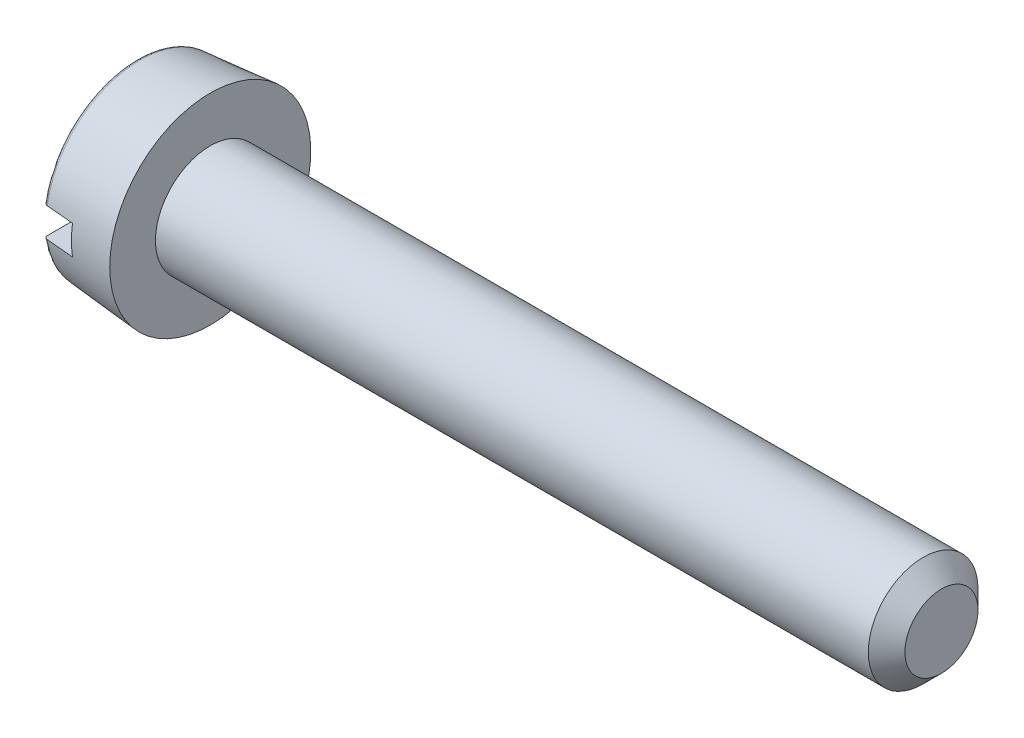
ISO-10303-21;
HEADER;
FILE_DESCRIPTION(('STEP AP214'),'2;1');
FILE_NAME('part.step','',(''),(''),'','','');
FILE_SCHEMA(('AUTOMOTIVE_DESIGN { 1 0 10303 214 1 1 1 1 }'));
ENDSEC;
DATA;
#1=APPLICATION_CONTEXT('core data for automotive mechanical design processes');
#2=APPLICATION_PROTOCOL_DEFINITION('international standard','automotive_design',2000,#1);
#3=PRODUCT_CONTEXT('',#1,'mechanical');
#4=PRODUCT('Part','Part','',(#3));
#5=PRODUCT_RELATED_PRODUCT_CATEGORY('part','',(#4));
#6=PRODUCT_DEFINITION_FORMATION('','',#4);
#7=PRODUCT_DEFINITION_CONTEXT('part definition',#1,'design');
#8=PRODUCT_DEFINITION('design','',#6,#7);
#9=PRODUCT_DEFINITION_SHAPE('','',#8);
#10=(LENGTH_UNIT() NAMED_UNIT(*) SI_UNIT(.MILLI.,.METRE.));
#11=(NAMED_UNIT(*) PLANE_ANGLE_UNIT() SI_UNIT($,.RADIAN.));
#12=(NAMED_UNIT(*) SI_UNIT($,.STERADIAN.) SOLID_ANGLE_UNIT());
#13=UNCERTAINTY_MEASURE_WITH_UNIT(LENGTH_MEASURE(1.E-05),#10,'distance_accuracy_value','');
#14=(GEOMETRIC_REPRESENTATION_CONTEXT(3) GLOBAL_UNCERTAINTY_ASSIGNED_CONTEXT((#13)) GLOBAL_UNIT_ASSIGNED_CONTEXT((#10,
#11,#12)) REPRESENTATION_CONTEXT('',''));
#15=CARTESIAN_POINT('',(0.,0.,0.));
#16=DIRECTION('',(0.,0.,1.));
#17=DIRECTION('',(1.,0.,0.));
#18=AXIS2_PLACEMENT_3D('',#15,#16,#17);
#19=CARTESIAN_POINT('',(0.,0.,0.));
#20=DIRECTION('',(-1.,0.,0.));
#21=DIRECTION('',(0.,0.,1.));
#22=AXIS2_PLACEMENT_3D('',#19,#20,#21);
#23=PLANE('',#22);
#24=DIRECTION('',(0.,0.,-1.));
#25=VECTOR('',#24,1.);
#26=CARTESIAN_POINT('',(0.,0.399999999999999,2.75));
#27=LINE('',#26,#25);
#28=CARTESIAN_POINT('',(0.,0.399999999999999,2.45096382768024));
#29=VERTEX_POINT('',#28);
#30=CARTESIAN_POINT('',(0.,0.399999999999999,-2.45096382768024));
#31=VERTEX_POINT('',#30);
#32=EDGE_CURVE('E103',#29,#31,#27,.T.);
#33=ORIENTED_EDGE('',*,*,#32,.F.);
#34=CARTESIAN_POINT('',(0.,0.,0.));
#35=DIRECTION('',(-1.,0.,0.));
#36=DIRECTION('',(0.,0.,1.));
#37=AXIS2_PLACEMENT_3D('',#34,#35,#36);
#38=CIRCLE('',#37,2.48338955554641);
#39=EDGE_CURVE('E106',#29,#31,#38,.T.);
#40=ORIENTED_EDGE('',*,*,#39,.T.);
#41=EDGE_LOOP('',(#33,#40));
#42=FACE_BOUND('',#41,.T.);
#43=ADVANCED_FACE('F35',(#42),#23,.T.);
#44=CARTESIAN_POINT('',(0.1,0.,0.));
#45=DIRECTION('',(-1.,0.,0.));
#46=DIRECTION('',(0.,0.,1.));
#47=AXIS2_PLACEMENT_3D('',#44,#45,#46);
#48=TOROIDAL_SURFACE('',#47,2.48338955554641,0.1);
#49=CARTESIAN_POINT('',(0.0485751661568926,0.399999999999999,-2.53782400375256));
#50=CARTESIAN_POINT('',(0.0533355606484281,0.399999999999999,-2.54071333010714));
#51=CARTESIAN_POINT('',(0.0583417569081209,0.399999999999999,-2.5432050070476));
#52=CARTESIAN_POINT('',(0.0687050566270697,0.399999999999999,-2.54731542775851));
#53=CARTESIAN_POINT('',(0.0740625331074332,0.399999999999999,-2.54893322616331));
#54=CARTESIAN_POINT('',(0.0849727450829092,0.399999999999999,-2.55124400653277));
#55=CARTESIAN_POINT('',(0.0905254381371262,0.399999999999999,-2.55193718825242));
#56=CARTESIAN_POINT('',(0.101666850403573,0.399999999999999,-2.55237774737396));
#57=CARTESIAN_POINT('',(0.107255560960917,0.399999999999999,-2.55212534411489));
#58=CARTESIAN_POINT('',(0.118292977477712,0.399999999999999,-2.55068537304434));
#59=CARTESIAN_POINT('',(0.123742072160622,0.399999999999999,-2.54950078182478));
#60=CARTESIAN_POINT('',(0.134364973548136,0.399999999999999,-2.54623584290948));
#61=CARTESIAN_POINT('',(0.139538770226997,0.399999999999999,-2.54415546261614));
#62=CARTESIAN_POINT('',(0.149479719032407,0.399999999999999,-2.53915450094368));
#63=CARTESIAN_POINT('',(0.1542457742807,0.399999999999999,-2.5362317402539));
#64=CARTESIAN_POINT('',(0.163225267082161,0.399999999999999,-2.52963434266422));
#65=CARTESIAN_POINT('',(0.167438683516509,0.399999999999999,-2.52595967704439));
#66=CARTESIAN_POINT('',(0.175235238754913,0.399999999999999,-2.51792797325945));
#67=CARTESIAN_POINT('',(0.178812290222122,0.399999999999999,-2.51356502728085));
#68=CARTESIAN_POINT('',(0.185193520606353,0.399999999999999,-2.50430657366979));
#69=CARTESIAN_POINT('',(0.187997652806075,0.399999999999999,-2.49941103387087));
#70=CARTESIAN_POINT('',(0.192789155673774,0.399999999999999,-2.48916309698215));
#71=CARTESIAN_POINT('',(0.194766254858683,0.399999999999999,-2.48380589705));
#72=CARTESIAN_POINT('',(0.197803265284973,0.399999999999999,-2.47283752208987));
#73=CARTESIAN_POINT('',(0.198863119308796,0.399999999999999,-2.46722633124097));
#74=CARTESIAN_POINT('',(0.200044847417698,0.399999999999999,-2.45584788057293));
#75=CARTESIAN_POINT('',(0.200157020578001,0.399999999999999,-2.45007961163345));
#76=CARTESIAN_POINT('',(0.199415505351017,0.399999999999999,-2.43860536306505));
#77=CARTESIAN_POINT('',(0.198561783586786,0.399999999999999,-2.43289938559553));
#78=CARTESIAN_POINT('',(0.195905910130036,0.399999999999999,-2.42168897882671));
#79=CARTESIAN_POINT('',(0.194100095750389,0.399999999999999,-2.41618541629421));
#80=CARTESIAN_POINT('',(0.189585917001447,0.399999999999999,-2.40556157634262));
#81=CARTESIAN_POINT('',(0.186877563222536,0.399999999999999,-2.40044129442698));
#82=CARTESIAN_POINT('',(0.180646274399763,0.399999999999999,-2.39075689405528));
#83=CARTESIAN_POINT('',(0.177127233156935,0.399999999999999,-2.38619027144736));
#84=CARTESIAN_POINT('',(0.16936410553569,0.399999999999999,-2.37772142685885));
#85=CARTESIAN_POINT('',(0.165120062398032,0.399999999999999,-2.37381916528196));
#86=CARTESIAN_POINT('',(0.15607995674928,0.399999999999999,-2.36683969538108));
#87=CARTESIAN_POINT('',(0.151290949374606,0.399999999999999,-2.36375335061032));
#88=CARTESIAN_POINT('',(0.14125723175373,0.399999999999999,-2.35844131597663));
#89=CARTESIAN_POINT('',(0.136012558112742,0.399999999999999,-2.35621555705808));
#90=CARTESIAN_POINT('',(0.125292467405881,0.399999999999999,-2.35271848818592));
#91=CARTESIAN_POINT('',(0.119821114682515,0.399999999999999,-2.35143471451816));
#92=CARTESIAN_POINT('',(0.10874007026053,0.399999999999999,-2.3498129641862));
#93=CARTESIAN_POINT('',(0.103130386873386,0.399999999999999,-2.34947493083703));
#94=CARTESIAN_POINT('',(0.0919839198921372,0.399999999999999,-2.34975394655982));
#95=CARTESIAN_POINT('',(0.0864469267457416,0.399999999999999,-2.3503627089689));
#96=CARTESIAN_POINT('',(0.0755538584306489,0.399999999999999,-2.35250103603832));
#97=CARTESIAN_POINT('',(0.0701977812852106,0.399999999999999,-2.35403059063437));
#98=CARTESIAN_POINT('',(0.0598152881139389,0.399999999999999,-2.35796437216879));
#99=CARTESIAN_POINT('',(0.0547889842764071,0.399999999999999,-2.36036889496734));
#100=CARTESIAN_POINT('',(0.0452064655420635,0.399999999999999,-2.36598034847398));
#101=CARTESIAN_POINT('',(0.040650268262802,0.399999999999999,-2.36918730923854));
#102=CARTESIAN_POINT('',(0.032091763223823,0.399999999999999,-2.37634229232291));
#103=CARTESIAN_POINT('',(0.0280948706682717,0.399999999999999,-2.38029679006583));
#104=CARTESIAN_POINT('',(0.0208109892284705,0.399999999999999,-2.3888128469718));
#105=CARTESIAN_POINT('',(0.0175240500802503,0.399999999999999,-2.39337444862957));
#106=CARTESIAN_POINT('',(0.0117067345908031,0.399999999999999,-2.4030406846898));
#107=CARTESIAN_POINT('',(0.00918709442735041,0.399999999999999,-2.40815178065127));
#108=CARTESIAN_POINT('',(0.00503040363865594,0.399999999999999,-2.41872109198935));
#109=CARTESIAN_POINT('',(0.00339341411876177,0.399999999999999,-2.42417933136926));
#110=CARTESIAN_POINT('',(0.00103079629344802,0.399999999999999,-2.43535569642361));
#111=CARTESIAN_POINT('',(0.000315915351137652,0.399999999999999,-2.44107609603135));
#112=CARTESIAN_POINT('',(-0.000148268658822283,0.399999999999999,-2.45255584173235));
#113=CARTESIAN_POINT('',(0.00010242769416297,0.399999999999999,-2.45831518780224));
#114=CARTESIAN_POINT('',(0.00156672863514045,0.399999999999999,-2.46973701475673));
#115=CARTESIAN_POINT('',(0.00278471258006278,0.399999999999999,-2.47539893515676));
#116=CARTESIAN_POINT('',(0.0061580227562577,0.399999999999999,-2.48643816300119));
#117=CARTESIAN_POINT('',(0.00831357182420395,0.399999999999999,-2.49181540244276));
#118=CARTESIAN_POINT('',(0.0134950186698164,0.399999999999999,-2.50210927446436));
#119=CARTESIAN_POINT('',(0.0165179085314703,0.399999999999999,-2.5070274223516));
#120=CARTESIAN_POINT('',(0.023352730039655,0.399999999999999,-2.51627478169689));
#121=CARTESIAN_POINT('',(0.0271636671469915,0.399999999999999,-2.52060472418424));
#122=CARTESIAN_POINT('',(0.0339390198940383,0.399999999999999,-2.52708853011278));
#123=CARTESIAN_POINT('',(0.0367007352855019,0.399999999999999,-2.52945777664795));
#124=CARTESIAN_POINT('',(0.04246511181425,0.399999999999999,-2.5338824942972));
#125=CARTESIAN_POINT('',(0.0454677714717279,0.399999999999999,-2.53593796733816));
#126=CARTESIAN_POINT('',(0.0485751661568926,0.399999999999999,-2.53782400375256));
#127=B_SPLINE_CURVE_WITH_KNOTS('',3,(#49,#50,#51,#52,#53,#54,#55,#56,#57,#58,#59,#60,#61,#62,
#63,#64,#65,#66,#67,#68,#69,#70,#71,#72,#73,#74,#75,#76,#77,#78,#79,#80,#81,#82,#83,#84,#85,#86,
#87,#88,#89,#90,#91,#92,#93,#94,#95,#96,#97,#98,#99,#100,#101,#102,#103,#104,#105,#106,#107,
#108,#109,#110,#111,#112,#113,#114,#115,#116,#117,#118,#119,#120,#121,#122,#123,#124,#125,#126),
.UNSPECIFIED.,.T.,.F.,(4,2,2,2,2,2,2,2,2,2,2,2,2,2,2,2,2,2,2,2,2,2,2,2,2,2,2,2,2,2,2,2,2,2,2,2,
2,2,4),(0.,0.0166927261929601,0.0334034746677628,0.0501106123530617,0.0668138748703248,
0.0834640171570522,0.100114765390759,0.116808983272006,0.133503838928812,0.150350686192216,
0.167198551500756,0.184249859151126,0.201302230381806,0.21852894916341,0.235756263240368,
0.253050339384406,0.270344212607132,0.287556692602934,0.304768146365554,0.321777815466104,
0.338786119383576,0.355565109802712,0.372343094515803,0.388975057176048,0.405606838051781,
0.422244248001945,0.438882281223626,0.455671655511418,0.472462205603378,0.489477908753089,
0.506494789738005,0.523708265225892,0.54092173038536,0.558213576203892,0.575509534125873,
0.592746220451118,0.609961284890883,0.620857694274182,0.631754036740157),.UNSPECIFIED.);
#128=CARTESIAN_POINT('',(0.0912844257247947,0.399999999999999,-2.55184945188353));
#129=VERTEX_POINT('',#128);
#130=EDGE_CURVE('E58',#31,#129,#127,.T.);
#131=ORIENTED_EDGE('',*,*,#130,.F.);
#132=ORIENTED_EDGE('',*,*,#39,.F.);
#133=CARTESIAN_POINT('',(0.066087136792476,0.399999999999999,2.35559521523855));
#134=CARTESIAN_POINT('',(0.0712950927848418,0.399999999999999,2.35369117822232));
#135=CARTESIAN_POINT('',(0.076666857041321,0.399999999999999,2.35222401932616));
#136=CARTESIAN_POINT('',(0.0875846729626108,0.399999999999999,2.35021144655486));
#137=CARTESIAN_POINT('',(0.0931309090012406,0.399999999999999,2.34966704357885));
#138=CARTESIAN_POINT('',(0.104234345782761,0.399999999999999,2.34951890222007));
#139=CARTESIAN_POINT('',(0.109791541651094,0.399999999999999,2.34991481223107));
#140=CARTESIAN_POINT('',(0.120758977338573,0.399999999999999,2.35163438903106));
#141=CARTESIAN_POINT('',(0.126169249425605,0.399999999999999,2.3529578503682));
#142=CARTESIAN_POINT('',(0.136691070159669,0.399999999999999,2.35649136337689));
#143=CARTESIAN_POINT('',(0.141802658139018,0.399999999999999,2.35870129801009));
#144=CARTESIAN_POINT('',(0.151586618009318,0.399999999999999,2.36394124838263));
#145=CARTESIAN_POINT('',(0.15625896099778,0.399999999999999,2.36697131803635));
#146=CARTESIAN_POINT('',(0.165074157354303,0.399999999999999,2.37379047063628));
#147=CARTESIAN_POINT('',(0.169212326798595,0.399999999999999,2.37758560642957));
#148=CARTESIAN_POINT('',(0.176803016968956,0.399999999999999,2.38580863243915));
#149=CARTESIAN_POINT('',(0.180255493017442,0.399999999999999,2.39023656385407));
#150=CARTESIAN_POINT('',(0.186425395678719,0.399999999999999,2.39966205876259));
#151=CARTESIAN_POINT('',(0.189132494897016,0.399999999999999,2.40466638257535));
#152=CARTESIAN_POINT('',(0.19367967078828,0.399999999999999,2.41505452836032));
#153=CARTESIAN_POINT('',(0.195519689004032,0.399999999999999,2.42043837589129));
#154=CARTESIAN_POINT('',(0.19830186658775,0.399999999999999,2.43150243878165));
#155=CARTESIAN_POINT('',(0.199232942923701,0.399999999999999,2.43718544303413));
#156=CARTESIAN_POINT('',(0.200133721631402,0.399999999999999,2.44862724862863));
#157=CARTESIAN_POINT('',(0.200103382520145,0.399999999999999,2.45438605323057));
#158=CARTESIAN_POINT('',(0.199078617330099,0.399999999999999,2.46584997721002));
#159=CARTESIAN_POINT('',(0.198078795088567,0.399999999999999,2.47155461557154));
#160=CARTESIAN_POINT('',(0.195132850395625,0.399999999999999,2.48271426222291));
#161=CARTESIAN_POINT('',(0.193186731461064,0.399999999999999,2.4881692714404));
#162=CARTESIAN_POINT('',(0.188406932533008,0.399999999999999,2.49865615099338));
#163=CARTESIAN_POINT('',(0.185575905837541,0.399999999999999,2.50368922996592));
#164=CARTESIAN_POINT('',(0.179101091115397,0.399999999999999,2.51320240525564));
#165=CARTESIAN_POINT('',(0.17545734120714,0.399999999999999,2.51768252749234));
#166=CARTESIAN_POINT('',(0.167497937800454,0.399999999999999,2.52591455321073));
#167=CARTESIAN_POINT('',(0.163189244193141,0.399999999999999,2.52967318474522));
#168=CARTESIAN_POINT('',(0.153995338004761,0.399999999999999,2.53640297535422));
#169=CARTESIAN_POINT('',(0.149110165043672,0.399999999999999,2.53937418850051));
#170=CARTESIAN_POINT('',(0.138966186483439,0.399999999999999,2.54440671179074));
#171=CARTESIAN_POINT('',(0.133712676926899,0.399999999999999,2.54647869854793));
#172=CARTESIAN_POINT('',(0.122930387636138,0.399999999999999,2.54970170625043));
#173=CARTESIAN_POINT('',(0.117401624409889,0.399999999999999,2.55085278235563));
#174=CARTESIAN_POINT('',(0.106281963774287,0.399999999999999,2.55219206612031));
#175=CARTESIAN_POINT('',(0.100692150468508,0.399999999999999,2.55238928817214));
#176=CARTESIAN_POINT('',(0.0895592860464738,0.399999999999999,2.55183933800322));
#177=CARTESIAN_POINT('',(0.0840162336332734,0.399999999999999,2.55109219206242));
#178=CARTESIAN_POINT('',(0.0731512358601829,0.399999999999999,2.5486799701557));
#179=CARTESIAN_POINT('',(0.0678286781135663,0.399999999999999,2.54701764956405));
#180=CARTESIAN_POINT('',(0.0575363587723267,0.399999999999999,2.54282694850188));
#181=CARTESIAN_POINT('',(0.0525666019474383,0.399999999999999,2.54029855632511));
#182=CARTESIAN_POINT('',(0.0430955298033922,0.399999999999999,2.53443716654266));
#183=CARTESIAN_POINT('',(0.03859644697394,0.399999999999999,2.53110056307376));
#184=CARTESIAN_POINT('',(0.0302151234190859,0.399999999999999,2.52372648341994));
#185=CARTESIAN_POINT('',(0.0263329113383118,0.399999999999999,2.51968897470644));
#186=CARTESIAN_POINT('',(0.0192521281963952,0.399999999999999,2.51098384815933));
#187=CARTESIAN_POINT('',(0.0160610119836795,0.399999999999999,2.5063101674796));
#188=CARTESIAN_POINT('',(0.0104977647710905,0.399999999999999,2.49649850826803));
#189=CARTESIAN_POINT('',(0.0081256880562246,0.399999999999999,2.49136049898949));
#190=CARTESIAN_POINT('',(0.00423822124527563,0.399999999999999,2.48069955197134));
#191=CARTESIAN_POINT('',(0.00273352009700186,0.399999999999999,2.4751727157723));
#192=CARTESIAN_POINT('',(0.000664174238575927,0.399999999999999,2.4639457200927));
#193=CARTESIAN_POINT('',(9.95845082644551E-05,0.399999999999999,2.45824555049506));
#194=CARTESIAN_POINT('',(-7.62295306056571E-05,0.399999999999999,2.4467793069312));
#195=CARTESIAN_POINT('',(0.000321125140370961,0.399999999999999,2.44101309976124));
#196=CARTESIAN_POINT('',(0.00207635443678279,0.399999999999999,2.42962883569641));
#197=CARTESIAN_POINT('',(0.00343421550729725,0.399999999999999,2.424010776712));
#198=CARTESIAN_POINT('',(0.00707734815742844,0.399999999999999,2.41307368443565));
#199=CARTESIAN_POINT('',(0.00936409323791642,0.399999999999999,2.4077551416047));
#200=CARTESIAN_POINT('',(0.014804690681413,0.399999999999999,2.39757966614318));
#201=CARTESIAN_POINT('',(0.0179587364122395,0.399999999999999,2.39272283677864));
#202=CARTESIAN_POINT('',(0.0250240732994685,0.399999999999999,2.38364579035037));
#203=CARTESIAN_POINT('',(0.0289303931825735,0.399999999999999,2.37942170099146));
#204=CARTESIAN_POINT('',(0.0374021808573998,0.399999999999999,2.3717039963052));
#205=CARTESIAN_POINT('',(0.0419667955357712,0.399999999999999,2.36820944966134));
#206=CARTESIAN_POINT('',(0.0498248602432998,0.399999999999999,2.3632007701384));
#207=CARTESIAN_POINT('',(0.0529598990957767,0.399999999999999,2.36143340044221));
#208=CARTESIAN_POINT('',(0.0594027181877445,0.399999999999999,2.35824787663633));
#209=CARTESIAN_POINT('',(0.062710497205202,0.399999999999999,2.35682972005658));
#210=CARTESIAN_POINT('',(0.066087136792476,0.399999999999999,2.35559521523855));
#211=B_SPLINE_CURVE_WITH_KNOTS('',3,(#133,#134,#135,#136,#137,#138,#139,#140,#141,#142,#143,
#144,#145,#146,#147,#148,#149,#150,#151,#152,#153,#154,#155,#156,#157,#158,#159,#160,#161,#162,
#163,#164,#165,#166,#167,#168,#169,#170,#171,#172,#173,#174,#175,#176,#177,#178,#179,#180,#181,
#182,#183,#184,#185,#186,#187,#188,#189,#190,#191,#192,#193,#194,#195,#196,#197,#198,#199,#200,
#201,#202,#203,#204,#205,#206,#207,#208,#209,#210),.UNSPECIFIED.,.T.,.F.,(4,2,2,2,2,2,2,2,2,2,2,
2,2,2,2,2,2,2,2,2,2,2,2,2,2,2,2,2,2,2,2,2,2,2,2,2,2,2,4),(0.,0.0166222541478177,
0.0332627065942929,0.0498969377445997,0.0665274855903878,0.0831558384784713,0.0997852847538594,
0.116551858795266,0.133319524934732,0.150308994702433,0.16729960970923,0.184494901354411,
0.201690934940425,0.218983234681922,0.236275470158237,0.253516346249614,0.270756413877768,
0.287826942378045,0.304896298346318,0.321757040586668,0.338616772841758,0.355316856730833,
0.372016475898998,0.388666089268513,0.405315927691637,0.422041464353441,0.438767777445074,
0.455666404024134,0.472566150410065,0.489669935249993,0.506774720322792,0.524032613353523,
0.541290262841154,0.558575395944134,0.575864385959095,0.593042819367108,0.610199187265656,
0.620976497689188,0.631753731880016),.UNSPECIFIED.);
#212=CARTESIAN_POINT('',(0.0912844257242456,0.399999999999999,2.55184945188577));
#213=VERTEX_POINT('',#212);
#214=EDGE_CURVE('E95',#213,#29,#211,.T.);
#215=ORIENTED_EDGE('',*,*,#214,.F.);
#216=CARTESIAN_POINT('',(0.0912844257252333,0.,0.));
#217=DIRECTION('',(-1.,0.,0.));
#218=DIRECTION('',(0.,0.,1.));
#219=AXIS2_PLACEMENT_3D('',#216,#217,#218);
#220=CIRCLE('',#219,2.58300902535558);
#221=EDGE_CURVE('E110',#129,#213,#220,.F.);
#222=ORIENTED_EDGE('',*,*,#221,.F.);
#223=EDGE_LOOP('',(#131,#132,#215,#222));
#224=FACE_BOUND('',#223,.T.);
#225=ADVANCED_FACE('F179',(#224),#48,.T.);
#226=CARTESIAN_POINT('',(-25.4,0.,0.));
#227=DIRECTION('',(-1.,0.,0.));
#228=DIRECTION('',(0.,0.,1.));
#229=AXIS2_PLACEMENT_3D('',#226,#227,#228);
#230=CYLINDRICAL_SURFACE('',#229,1.5);
#231=CARTESIAN_POINT('',(21.5,0.,0.));
#232=DIRECTION('',(1.,0.,0.));
#233=DIRECTION('',(0.,0.,-1.));
#234=AXIS2_PLACEMENT_3D('',#231,#232,#233);
#235=CIRCLE('',#234,1.5);
#236=CARTESIAN_POINT('',(21.5,0.,-1.5));
#237=VERTEX_POINT('',#236);
#238=EDGE_CURVE('E43',#237,#237,#235,.F.);
#239=ORIENTED_EDGE('',*,*,#238,.T.);
#240=EDGE_LOOP('',(#239));
#241=FACE_BOUND('',#240,.T.);
#242=CARTESIAN_POINT('',(2.,0.,0.));
#243=DIRECTION('',(-1.,0.,0.));
#244=DIRECTION('',(0.,0.,1.));
#245=AXIS2_PLACEMENT_3D('',#242,#243,#244);
#246=CIRCLE('',#245,1.5);
#247=CARTESIAN_POINT('',(2.,0.,1.5));
#248=VERTEX_POINT('',#247);
#249=EDGE_CURVE('E107',#248,#248,#246,.T.);
#250=ORIENTED_EDGE('',*,*,#249,.F.);
#251=EDGE_LOOP('',(#250));
#252=FACE_BOUND('',#251,.T.);
#253=ADVANCED_FACE('F37',(#241,#252),#230,.T.);
#254=CARTESIAN_POINT('',(2.,1.5,0.));
#255=DIRECTION('',(-1.,0.,0.));
#256=DIRECTION('',(0.,0.,1.));
#257=AXIS2_PLACEMENT_3D('',#254,#255,#256);
#258=PLANE('',#257);
#259=CARTESIAN_POINT('',(2.,0.,0.));
#260=DIRECTION('',(-1.,0.,0.));
#261=DIRECTION('',(0.,0.,1.));
#262=AXIS2_PLACEMENT_3D('',#259,#260,#261);
#263=CIRCLE('',#262,2.75);
#264=CARTESIAN_POINT('',(2.,0.,2.75));
#265=VERTEX_POINT('',#264);
#266=EDGE_CURVE('E112',#265,#265,#263,.T.);
#267=ORIENTED_EDGE('',*,*,#266,.F.);
#268=EDGE_LOOP('',(#267));
#269=FACE_BOUND('',#268,.T.);
#270=ORIENTED_EDGE('',*,*,#249,.T.);
#271=EDGE_LOOP('',(#270));
#272=FACE_BOUND('',#271,.T.);
#273=ADVANCED_FACE('F156',(#269,#272),#258,.F.);
#274=CARTESIAN_POINT('',(0.,0.,0.));
#275=DIRECTION('',(1.,0.,0.));
#276=DIRECTION('',(0.,0.,-1.));
#277=AXIS2_PLACEMENT_3D('',#274,#275,#276);
#278=CONICAL_SURFACE('',#277,2.57502267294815,0.0872664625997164);
#279=CARTESIAN_POINT('',(5.21123588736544,0.399999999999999,3.00443640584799));
#280=CARTESIAN_POINT('',(4.41342358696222,0.399999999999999,2.93401988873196));
#281=CARTESIAN_POINT('',(3.61561486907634,0.399999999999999,2.86356274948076));
#282=CARTESIAN_POINT('',(2.02000692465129,0.399999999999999,2.72254136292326));
#283=CARTESIAN_POINT('',(1.22220769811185,0.399999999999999,2.65197711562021));
#284=CARTESIAN_POINT('',(-0.373378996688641,0.399999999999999,2.51071564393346));
#285=CARTESIAN_POINT('',(-1.17116646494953,0.399999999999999,2.44001841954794));
#286=CARTESIAN_POINT('',(-2.76672581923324,0.399999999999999,2.298448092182));
#287=CARTESIAN_POINT('',(-3.56449770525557,0.399999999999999,2.22757498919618));
#288=CARTESIAN_POINT('',(-4.36225986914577,0.399999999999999,2.15659249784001));
#289=B_SPLINE_CURVE_WITH_KNOTS('',3,(#279,#280,#281,#282,#283,#284,#285,#286,#287,#288),
.UNSPECIFIED.,.F.,.F.,(4,2,2,2,4),(0.,2.40274147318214,4.80548287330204,7.20822430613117,
9.6109658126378),.UNSPECIFIED.);
#290=CARTESIAN_POINT('',(0.85,0.399999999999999,2.61901832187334));
#291=VERTEX_POINT('',#290);
#292=EDGE_CURVE('E162',#291,#213,#289,.T.);
#293=ORIENTED_EDGE('',*,*,#292,.F.);
#294=CARTESIAN_POINT('',(0.85,0.,0.));
#295=DIRECTION('',(1.,0.,0.));
#296=DIRECTION('',(0.,0.,-1.));
#297=AXIS2_PLACEMENT_3D('',#294,#295,#296);
#298=CIRCLE('',#297,2.64938803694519);
#299=CARTESIAN_POINT('',(0.85,-0.4,2.61901832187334));
#300=VERTEX_POINT('',#299);
#301=EDGE_CURVE('E206',#300,#291,#298,.F.);
#302=ORIENTED_EDGE('',*,*,#301,.F.);
#303=CARTESIAN_POINT('',(-4.36225986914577,-0.4,2.15659249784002));
#304=CARTESIAN_POINT('',(-3.02252879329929,-0.4,2.27578971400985));
#305=CARTESIAN_POINT('',(-1.68277158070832,-0.4,2.3946924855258));
#306=CARTESIAN_POINT('',(-0.0871929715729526,-0.4,2.5360455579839));
#307=CARTESIAN_POINT('',(0.168610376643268,-0.4,2.55869953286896));
#308=CARTESIAN_POINT('',(2.02000114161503,-0.4,2.72260692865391));
#309=CARTESIAN_POINT('',(3.61561248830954,-0.4,2.86359016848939));
#310=CARTESIAN_POINT('',(5.21123588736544,-0.4,3.00443640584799));
#311=B_SPLINE_CURVE_WITH_KNOTS('',3,(#303,#304,#305,#306,#307,#308,#309,#310),.UNSPECIFIED.,.F.,
.F.,(4,2,2,4),(0.,4.03506939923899,4.80548292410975,9.61096578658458),.UNSPECIFIED.);
#312=CARTESIAN_POINT('',(0.0912844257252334,-0.4,2.5518494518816));
#313=VERTEX_POINT('',#312);
#314=EDGE_CURVE('E140',#313,#300,#311,.T.);
#315=ORIENTED_EDGE('',*,*,#314,.F.);
#316=CARTESIAN_POINT('',(0.0912844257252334,-0.4,-2.55184945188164));
#317=VERTEX_POINT('',#316);
#318=EDGE_CURVE('E116',#313,#317,#220,.F.);
#319=ORIENTED_EDGE('',*,*,#318,.T.);
#320=CARTESIAN_POINT('',(5.21123588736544,-0.4,-3.00443640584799));
#321=CARTESIAN_POINT('',(4.41342358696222,-0.4,-2.93401988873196));
#322=CARTESIAN_POINT('',(3.61561486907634,-0.4,-2.86356274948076));
#323=CARTESIAN_POINT('',(2.02000692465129,-0.4,-2.72254136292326));
#324=CARTESIAN_POINT('',(1.22220769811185,-0.4,-2.65197711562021));
#325=CARTESIAN_POINT('',(-0.373378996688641,-0.4,-2.51071564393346));
#326=CARTESIAN_POINT('',(-1.17116646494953,-0.4,-2.44001841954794));
#327=CARTESIAN_POINT('',(-2.76672581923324,-0.4,-2.298448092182));
#328=CARTESIAN_POINT('',(-3.56449770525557,-0.4,-2.22757498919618));
#329=CARTESIAN_POINT('',(-4.36225986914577,-0.4,-2.15659249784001));
#330=B_SPLINE_CURVE_WITH_KNOTS('',3,(#320,#321,#322,#323,#324,#325,#326,#327,#328,#329),
.UNSPECIFIED.,.F.,.F.,(4,2,2,2,4),(0.,2.40274147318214,4.80548287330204,7.20822430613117,
9.6109658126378),.UNSPECIFIED.);
#331=CARTESIAN_POINT('',(0.85,-0.4,-2.61901832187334));
#332=VERTEX_POINT('',#331);
#333=EDGE_CURVE('E90',#332,#317,#330,.T.);
#334=ORIENTED_EDGE('',*,*,#333,.F.);
#335=CARTESIAN_POINT('',(0.85,0.399999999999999,-2.61901832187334));
#336=VERTEX_POINT('',#335);
#337=EDGE_CURVE('E207',#336,#332,#298,.F.);
#338=ORIENTED_EDGE('',*,*,#337,.F.);
#339=CARTESIAN_POINT('',(-4.36225986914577,0.399999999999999,-2.15659249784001));
#340=CARTESIAN_POINT('',(-3.02252879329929,0.399999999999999,-2.27578971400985));
#341=CARTESIAN_POINT('',(-1.68277158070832,0.399999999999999,-2.3946924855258));
#342=CARTESIAN_POINT('',(-0.0871929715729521,0.399999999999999,-2.5360455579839));
#343=CARTESIAN_POINT('',(0.168610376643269,0.399999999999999,-2.55869953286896));
#344=CARTESIAN_POINT('',(2.02000114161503,0.399999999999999,-2.72260692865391));
#345=CARTESIAN_POINT('',(3.61561248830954,0.399999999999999,-2.86359016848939));
#346=CARTESIAN_POINT('',(5.21123588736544,0.399999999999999,-3.00443640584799));
#347=B_SPLINE_CURVE_WITH_KNOTS('',3,(#339,#340,#341,#342,#343,#344,#345,#346),.UNSPECIFIED.,.F.,
.F.,(4,2,2,4),(0.,4.03506939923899,4.80548292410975,9.61096578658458),.UNSPECIFIED.);
#348=EDGE_CURVE('E166',#129,#336,#347,.T.);
#349=ORIENTED_EDGE('',*,*,#348,.F.);
#350=ORIENTED_EDGE('',*,*,#221,.T.);
#351=EDGE_LOOP('',(#293,#302,#315,#319,#334,#338,#349,#350));
#352=FACE_BOUND('',#351,.T.);
#353=ORIENTED_EDGE('',*,*,#266,.T.);
#354=EDGE_LOOP('',(#353));
#355=FACE_BOUND('',#354,.T.);
#356=ADVANCED_FACE('F152',(#352,#355),#278,.T.);
#357=DIRECTION('',(0.,0.,1.));
#358=VECTOR('',#357,1.);
#359=CARTESIAN_POINT('',(0.,-0.4,-2.75));
#360=LINE('',#359,#358);
#361=CARTESIAN_POINT('',(0.,-0.4,-2.45096382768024));
#362=VERTEX_POINT('',#361);
#363=CARTESIAN_POINT('',(0.,-0.4,2.45096382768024));
#364=VERTEX_POINT('',#363);
#365=EDGE_CURVE('E50',#362,#364,#360,.T.);
#366=ORIENTED_EDGE('',*,*,#365,.F.);
#367=EDGE_CURVE('E101',#362,#364,#38,.T.);
#368=ORIENTED_EDGE('',*,*,#367,.T.);
#369=EDGE_LOOP('',(#366,#368));
#370=FACE_BOUND('',#369,.T.);
#371=ADVANCED_FACE('F100',(#370),#23,.T.);
#372=CARTESIAN_POINT('',(22.,1.5,0.));
#373=DIRECTION('',(1.,0.,0.));
#374=DIRECTION('',(0.,0.,-1.));
#375=AXIS2_PLACEMENT_3D('',#372,#373,#374);
#376=PLANE('',#375);
#377=CARTESIAN_POINT('',(22.,0.,0.));
#378=DIRECTION('',(1.,0.,0.));
#379=DIRECTION('',(0.,0.,-1.));
#380=AXIS2_PLACEMENT_3D('',#377,#378,#379);
#381=CIRCLE('',#380,1.);
#382=CARTESIAN_POINT('',(22.,0.,-1.));
#383=VERTEX_POINT('',#382);
#384=EDGE_CURVE('E11',#383,#383,#381,.T.);
#385=ORIENTED_EDGE('',*,*,#384,.T.);
#386=EDGE_LOOP('',(#385));
#387=FACE_BOUND('',#386,.T.);
#388=ADVANCED_FACE('F192',(#387),#376,.T.);
#389=CARTESIAN_POINT('',(0.0485751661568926,-0.4,-2.53782400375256));
#390=CARTESIAN_POINT('',(0.0437427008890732,-0.4,-2.53489033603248));
#391=CARTESIAN_POINT('',(0.0391565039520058,-0.4,-2.53154249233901));
#392=CARTESIAN_POINT('',(0.0306096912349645,-0.4,-2.52411912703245));
#393=CARTESIAN_POINT('',(0.0266499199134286,-0.4,-2.52004263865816));
#394=CARTESIAN_POINT('',(0.019472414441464,-0.4,-2.51128827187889));
#395=CARTESIAN_POINT('',(0.0162539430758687,-0.4,-2.5066109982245));
#396=CARTESIAN_POINT('',(0.010640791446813,-0.4,-2.49678789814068));
#397=CARTESIAN_POINT('',(0.0082459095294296,-0.4,-2.4916421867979));
#398=CARTESIAN_POINT('',(0.00432284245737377,-0.4,-2.48097764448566));
#399=CARTESIAN_POINT('',(0.00280265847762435,-0.4,-2.47545587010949));
#400=CARTESIAN_POINT('',(0.000701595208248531,-0.4,-2.46423612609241));
#401=CARTESIAN_POINT('',(0.000120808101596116,-0.4,-2.45853813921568));
#402=CARTESIAN_POINT('',(-8.77639340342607E-05,-0.4,-2.44707338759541));
#403=CARTESIAN_POINT('',(0.00029305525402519,-0.4,-2.44130646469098));
#404=CARTESIAN_POINT('',(0.00201549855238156,-0.4,-2.42991778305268));
#405=CARTESIAN_POINT('',(0.00335714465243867,-0.4,-2.42429602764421));
#406=CARTESIAN_POINT('',(0.00696895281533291,-0.4,-2.41334782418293));
#407=CARTESIAN_POINT('',(0.0092407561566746,-0.4,-2.40802191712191));
#408=CARTESIAN_POINT('',(0.0146521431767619,-0.4,-2.39783066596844));
#409=CARTESIAN_POINT('',(0.0177917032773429,-0.4,-2.39296530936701));
#410=CARTESIAN_POINT('',(0.0248287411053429,-0.4,-2.38387042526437));
#411=CARTESIAN_POINT('',(0.0287209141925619,-0.4,-2.37963679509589));
#412=CARTESIAN_POINT('',(0.0371689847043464,-0.4,-2.37189344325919));
#413=CARTESIAN_POINT('',(0.0417248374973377,-0.4,-2.36838367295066));
#414=CARTESIAN_POINT('',(0.0513088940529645,-0.4,-2.36223607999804));
#415=CARTESIAN_POINT('',(0.0563303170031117,-0.4,-2.35958768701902));
#416=CARTESIAN_POINT('',(0.0667506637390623,-0.4,-2.35518417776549));
#417=CARTESIAN_POINT('',(0.0721495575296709,-0.4,-2.35342899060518));
#418=CARTESIAN_POINT('',(0.0830969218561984,-0.4,-2.35088371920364));
#419=CARTESIAN_POINT('',(0.08864257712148,-0.4,-2.35008151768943));
#420=CARTESIAN_POINT('',(0.0997895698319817,-0.4,-2.34942645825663));
#421=CARTESIAN_POINT('',(0.105390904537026,-0.4,-2.34957355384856));
#422=CARTESIAN_POINT('',(0.116450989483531,-0.4,-2.35080823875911));
#423=CARTESIAN_POINT('',(0.121910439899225,-0.4,-2.35188957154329));
#424=CARTESIAN_POINT('',(0.132571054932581,-0.4,-2.35495102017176));
#425=CARTESIAN_POINT('',(0.137772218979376,-0.4,-2.35693113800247));
#426=CARTESIAN_POINT('',(0.147785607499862,-0.4,-2.36173694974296));
#427=CARTESIAN_POINT('',(0.152596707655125,-0.4,-2.36456498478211));
#428=CARTESIAN_POINT('',(0.161682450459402,-0.4,-2.37098051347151));
#429=CARTESIAN_POINT('',(0.165957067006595,-0.4,-2.3745680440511));
#430=CARTESIAN_POINT('',(0.173898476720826,-0.4,-2.38244089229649));
#431=CARTESIAN_POINT('',(0.177558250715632,-0.4,-2.38673328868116));
#432=CARTESIAN_POINT('',(0.184116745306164,-0.4,-2.39586460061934));
#433=CARTESIAN_POINT('',(0.187015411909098,-0.4,-2.40070355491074));
#434=CARTESIAN_POINT('',(0.192010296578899,-0.4,-2.41086084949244));
#435=CARTESIAN_POINT('',(0.194095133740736,-0.4,-2.41618478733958));
#436=CARTESIAN_POINT('',(0.197351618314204,-0.4,-2.42710502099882));
#437=CARTESIAN_POINT('',(0.198523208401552,-0.4,-2.43270133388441));
#438=CARTESIAN_POINT('',(0.199929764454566,-0.4,-2.44406834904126));
#439=CARTESIAN_POINT('',(0.200155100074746,-0.4,-2.4498402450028));
#440=CARTESIAN_POINT('',(0.199636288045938,-0.4,-2.4613404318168));
#441=CARTESIAN_POINT('',(0.198892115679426,-0.4,-2.46706872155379));
#442=CARTESIAN_POINT('',(0.196450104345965,-0.4,-2.47833342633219));
#443=CARTESIAN_POINT('',(0.19474990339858,-0.4,-2.48386932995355));
#444=CARTESIAN_POINT('',(0.190438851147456,-0.4,-2.49457461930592));
#445=CARTESIAN_POINT('',(0.18782801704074,-0.4,-2.49974401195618));
#446=CARTESIAN_POINT('',(0.181784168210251,-0.4,-2.50953562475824));
#447=CARTESIAN_POINT('',(0.178356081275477,-0.4,-2.51416088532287));
#448=CARTESIAN_POINT('',(0.170763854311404,-0.4,-2.52276187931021));
#449=CARTESIAN_POINT('',(0.166599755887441,-0.4,-2.52673764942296));
#450=CARTESIAN_POINT('',(0.157703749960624,-0.4,-2.53387831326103));
#451=CARTESIAN_POINT('',(0.152978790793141,-0.4,-2.53705186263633));
#452=CARTESIAN_POINT('',(0.143058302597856,-0.4,-2.54254944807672));
#453=CARTESIAN_POINT('',(0.137862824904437,-0.4,-2.54487357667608));
#454=CARTESIAN_POINT('',(0.127215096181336,-0.4,-2.54857855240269));
#455=CARTESIAN_POINT('',(0.121766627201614,-0.4,-2.54997027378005));
#456=CARTESIAN_POINT('',(0.110711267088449,-0.4,-2.55181190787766));
#457=CARTESIAN_POINT('',(0.105104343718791,-0.4,-2.55226162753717));
#458=CARTESIAN_POINT('',(0.0939347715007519,-0.4,-2.552205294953));
#459=CARTESIAN_POINT('',(0.0883720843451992,-0.4,-2.55170582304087));
#460=CARTESIAN_POINT('',(0.0774146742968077,-0.4,-2.54977933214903));
#461=CARTESIAN_POINT('',(0.0720197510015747,-0.4,-2.54835346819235));
#462=CARTESIAN_POINT('',(0.0636134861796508,-0.4,-2.54535751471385));
#463=CARTESIAN_POINT('',(0.0605001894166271,-0.4,-2.54406538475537));
#464=CARTESIAN_POINT('',(0.0544205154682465,-0.4,-2.54117250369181));
#465=CARTESIAN_POINT('',(0.0514541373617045,-0.4,-2.53957175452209));
#466=CARTESIAN_POINT('',(0.0485751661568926,-0.4,-2.53782400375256));
#467=B_SPLINE_CURVE_WITH_KNOTS('',3,(#389,#390,#391,#392,#393,#394,#395,#396,#397,#398,#399,
#400,#401,#402,#403,#404,#405,#406,#407,#408,#409,#410,#411,#412,#413,#414,#415,#416,#417,#418,
#419,#420,#421,#422,#423,#424,#425,#426,#427,#428,#429,#430,#431,#432,#433,#434,#435,#436,#437,
#438,#439,#440,#441,#442,#443,#444,#445,#446,#447,#448,#449,#450,#451,#452,#453,#454,#455,#456,
#457,#458,#459,#460,#461,#462,#463,#464,#465,#466),.UNSPECIFIED.,.T.,.F.,(4,2,2,2,2,2,2,2,2,2,2,
2,2,2,2,2,2,2,2,2,2,2,2,2,2,2,2,2,2,2,2,2,2,2,2,2,2,2,4),(0.,0.0169472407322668,
0.0339171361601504,0.0508700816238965,0.0678188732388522,0.0849203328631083,0.102023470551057,
0.119280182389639,0.136537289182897,0.153824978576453,0.171112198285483,0.188281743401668,
0.205450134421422,0.222399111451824,0.239346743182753,0.256076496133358,0.272805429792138,
0.289423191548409,0.306040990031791,0.322705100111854,0.339370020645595,0.356213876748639,
0.3730589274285,0.390131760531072,0.407205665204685,0.424452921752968,0.441700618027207,
0.458991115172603,0.476281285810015,0.493469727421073,0.510657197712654,0.527650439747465,
0.544641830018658,0.561431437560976,0.578224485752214,0.594901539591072,0.611557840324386,
0.621654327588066,0.631750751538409),.UNSPECIFIED.);
#468=EDGE_CURVE('E86',#317,#362,#467,.T.);
#469=ORIENTED_EDGE('',*,*,#468,.F.);
#470=ORIENTED_EDGE('',*,*,#318,.F.);
#471=CARTESIAN_POINT('',(0.066087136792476,-0.4,2.35559521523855));
#472=CARTESIAN_POINT('',(0.0608105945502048,-0.4,2.35752487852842));
#473=CARTESIAN_POINT('',(0.0556944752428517,-0.4,2.3599059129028));
#474=CARTESIAN_POINT('',(0.0459323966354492,-0.4,2.36549830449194));
#475=CARTESIAN_POINT('',(0.0412870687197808,-0.4,2.36871075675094));
#476=CARTESIAN_POINT('',(0.0326043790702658,-0.4,2.37586468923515));
#477=CARTESIAN_POINT('',(0.0285663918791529,-0.4,2.37980541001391));
#478=CARTESIAN_POINT('',(0.0212026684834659,-0.4,2.38830165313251));
#479=CARTESIAN_POINT('',(0.0178767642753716,-0.4,2.39285703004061));
#480=CARTESIAN_POINT('',(0.0119934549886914,-0.4,2.4025019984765));
#481=CARTESIAN_POINT('',(0.00944402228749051,-0.4,2.40759645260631));
#482=CARTESIAN_POINT('',(0.00522519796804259,-0.4,2.41813782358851));
#483=CARTESIAN_POINT('',(0.00355590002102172,-0.4,2.42358477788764));
#484=CARTESIAN_POINT('',(0.00112661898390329,-0.4,2.43474435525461));
#485=CARTESIAN_POINT('',(0.000377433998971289,-0.4,2.44045933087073));
#486=CARTESIAN_POINT('',(-0.000155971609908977,-0.4,2.45193424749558));
#487=CARTESIAN_POINT('',(5.9843753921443E-05,-0.4,2.45769419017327));
#488=CARTESIAN_POINT('',(0.0014548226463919,-0.4,2.4691245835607));
#489=CARTESIAN_POINT('',(0.00263861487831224,-0.4,2.47479447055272));
#490=CARTESIAN_POINT('',(0.00594479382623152,-0.4,2.48585382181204));
#491=CARTESIAN_POINT('',(0.0080671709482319,-0.4,2.4912432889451));
#492=CARTESIAN_POINT('',(0.0131842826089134,-0.4,2.50156580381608));
#493=CARTESIAN_POINT('',(0.0161757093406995,-0.4,2.50650049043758));
#494=CARTESIAN_POINT('',(0.0229526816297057,-0.4,2.51579078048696));
#495=CARTESIAN_POINT('',(0.0267381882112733,-0.4,2.52014641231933));
#496=CARTESIAN_POINT('',(0.0349549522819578,-0.4,2.52810621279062));
#497=CARTESIAN_POINT('',(0.0393791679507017,-0.4,2.53171764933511));
#498=CARTESIAN_POINT('',(0.0487773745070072,-0.4,2.53813557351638));
#499=CARTESIAN_POINT('',(0.0537513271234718,-0.4,2.54094211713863));
#500=CARTESIAN_POINT('',(0.0640426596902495,-0.4,2.54563498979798));
#501=CARTESIAN_POINT('',(0.0693551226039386,-0.4,2.5475321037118));
#502=CARTESIAN_POINT('',(0.0802247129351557,-0.4,2.55039839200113));
#503=CARTESIAN_POINT('',(0.0857818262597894,-0.4,2.55136761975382));
#504=CARTESIAN_POINT('',(0.0969295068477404,-0.4,2.55234385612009));
#505=CARTESIAN_POINT('',(0.102519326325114,-0.4,2.55235942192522));
#506=CARTESIAN_POINT('',(0.113621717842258,-0.4,2.55144947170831));
#507=CARTESIAN_POINT('',(0.119134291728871,-0.4,2.55052397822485));
#508=CARTESIAN_POINT('',(0.12991315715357,-0.4,2.54776325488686));
#509=CARTESIAN_POINT('',(0.135179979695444,-0.4,2.54593009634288));
#510=CARTESIAN_POINT('',(0.14533338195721,-0.4,2.54141002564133));
#511=CARTESIAN_POINT('',(0.150219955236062,-0.4,2.53872309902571));
#512=CARTESIAN_POINT('',(0.159502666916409,-0.4,2.5325586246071));
#513=CARTESIAN_POINT('',(0.163896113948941,-0.4,2.52907702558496));
#514=CARTESIAN_POINT('',(0.172043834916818,-0.4,2.52143276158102));
#515=CARTESIAN_POINT('',(0.175798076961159,-0.4,2.51727006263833));
#516=CARTESIAN_POINT('',(0.182604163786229,-0.4,2.50833478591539));
#517=CARTESIAN_POINT('',(0.185648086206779,-0.4,2.50355617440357));
#518=CARTESIAN_POINT('',(0.19090152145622,-0.4,2.49356047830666));
#519=CARTESIAN_POINT('',(0.193110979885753,-0.4,2.4883433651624));
#520=CARTESIAN_POINT('',(0.196659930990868,-0.4,2.47755170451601));
#521=CARTESIAN_POINT('',(0.197988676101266,-0.4,2.47197362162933));
#522=CARTESIAN_POINT('',(0.199699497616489,-0.4,2.46067407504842));
#523=CARTESIAN_POINT('',(0.20008152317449,-0.4,2.45495260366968));
#524=CARTESIAN_POINT('',(0.199888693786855,-0.4,2.44347761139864));
#525=CARTESIAN_POINT('',(0.199305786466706,-0.4,2.43772422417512));
#526=CARTESIAN_POINT('',(0.197183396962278,-0.4,2.42639649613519));
#527=CARTESIAN_POINT('',(0.195643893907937,-0.4,2.42082215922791));
#528=CARTESIAN_POINT('',(0.191647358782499,-0.4,2.41000689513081));
#529=CARTESIAN_POINT('',(0.189189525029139,-0.4,2.40476626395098));
#530=CARTESIAN_POINT('',(0.183422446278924,-0.4,2.39477626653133));
#531=CARTESIAN_POINT('',(0.180113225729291,-0.4,2.39002688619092));
#532=CARTESIAN_POINT('',(0.172762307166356,-0.4,2.38119455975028));
#533=CARTESIAN_POINT('',(0.168726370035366,-0.4,2.37710682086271));
#534=CARTESIAN_POINT('',(0.160017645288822,-0.4,2.36967805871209));
#535=CARTESIAN_POINT('',(0.155344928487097,-0.4,2.36633695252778));
#536=CARTESIAN_POINT('',(0.145561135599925,-0.4,2.36054338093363));
#537=CARTESIAN_POINT('',(0.140456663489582,-0.4,2.35807976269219));
#538=CARTESIAN_POINT('',(0.129901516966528,-0.4,2.35405629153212));
#539=CARTESIAN_POINT('',(0.124450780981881,-0.4,2.35249659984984));
#540=CARTESIAN_POINT('',(0.113430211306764,-0.4,2.35034396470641));
#541=CARTESIAN_POINT('',(0.107862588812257,-0.4,2.34973965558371));
#542=CARTESIAN_POINT('',(0.0967101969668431,-0.4,2.34948171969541));
#543=CARTESIAN_POINT('',(0.0911254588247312,-0.4,2.34982687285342));
#544=CARTESIAN_POINT('',(0.0822854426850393,-0.4,2.35112999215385));
#545=CARTESIAN_POINT('',(0.078983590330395,-0.4,2.35179110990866));
#546=CARTESIAN_POINT('',(0.072464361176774,-0.4,2.35344593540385));
#547=CARTESIAN_POINT('',(0.0692469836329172,-0.4,2.3544396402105));
#548=CARTESIAN_POINT('',(0.066087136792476,-0.4,2.35559521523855));
#549=B_SPLINE_CURVE_WITH_KNOTS('',3,(#471,#472,#473,#474,#475,#476,#477,#478,#479,#480,#481,
#482,#483,#484,#485,#486,#487,#488,#489,#490,#491,#492,#493,#494,#495,#496,#497,#498,#499,#500,
#501,#502,#503,#504,#505,#506,#507,#508,#509,#510,#511,#512,#513,#514,#515,#516,#517,#518,#519,
#520,#521,#522,#523,#524,#525,#526,#527,#528,#529,#530,#531,#532,#533,#534,#535,#536,#537,#538,
#539,#540,#541,#542,#543,#544,#545,#546,#547,#548),.UNSPECIFIED.,.T.,.F.,(4,2,2,2,2,2,2,2,2,2,2,
2,2,2,2,2,2,2,2,2,2,2,2,2,2,2,2,2,2,2,2,2,2,2,2,2,2,2,4),(0.,0.0168424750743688,
0.0337072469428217,0.0505545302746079,0.0673978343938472,0.0844086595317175,0.101421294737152,
0.118631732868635,0.13584281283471,0.153136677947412,0.170430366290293,0.18765907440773,
0.204886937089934,0.221937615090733,0.238987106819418,0.255829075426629,0.272670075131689,
0.289359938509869,0.306049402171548,0.3227009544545,0.339352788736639,0.356091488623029,
0.372831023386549,0.389749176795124,0.406668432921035,0.423790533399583,0.440913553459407,
0.458180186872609,0.475447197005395,0.492729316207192,0.51001093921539,0.527161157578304,
0.54430947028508,0.561231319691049,0.578156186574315,0.594878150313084,0.611578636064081,
0.62166480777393,0.631750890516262),.UNSPECIFIED.);
#550=EDGE_CURVE('E96',#364,#313,#549,.T.);
#551=ORIENTED_EDGE('',*,*,#550,.F.);
#552=ORIENTED_EDGE('',*,*,#367,.F.);
#553=EDGE_LOOP('',(#469,#470,#551,#552));
#554=FACE_BOUND('',#553,.T.);
#555=ADVANCED_FACE('F105',(#554),#48,.T.);
#556=CARTESIAN_POINT('',(0.85,0.399999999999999,2.75));
#557=DIRECTION('',(0.,1.,0.));
#558=DIRECTION('',(0.,0.,1.));
#559=AXIS2_PLACEMENT_3D('',#556,#557,#558);
#560=PLANE('',#559);
#561=ORIENTED_EDGE('',*,*,#348,.T.);
#562=DIRECTION('',(0.,0.,-1.));
#563=VECTOR('',#562,1.);
#564=CARTESIAN_POINT('',(0.85,0.399999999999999,2.75));
#565=LINE('',#564,#563);
#566=EDGE_CURVE('E102',#291,#336,#565,.T.);
#567=ORIENTED_EDGE('',*,*,#566,.F.);
#568=ORIENTED_EDGE('',*,*,#292,.T.);
#569=ORIENTED_EDGE('',*,*,#214,.T.);
#570=ORIENTED_EDGE('',*,*,#32,.T.);
#571=ORIENTED_EDGE('',*,*,#130,.T.);
#572=EDGE_LOOP('',(#561,#567,#568,#569,#570,#571));
#573=FACE_BOUND('',#572,.T.);
#574=ADVANCED_FACE('F132',(#573),#560,.F.);
#575=CARTESIAN_POINT('',(0.85,-0.4,-2.75));
#576=DIRECTION('',(0.,-1.,0.));
#577=DIRECTION('',(0.,0.,-1.));
#578=AXIS2_PLACEMENT_3D('',#575,#576,#577);
#579=PLANE('',#578);
#580=ORIENTED_EDGE('',*,*,#333,.T.);
#581=ORIENTED_EDGE('',*,*,#468,.T.);
#582=ORIENTED_EDGE('',*,*,#365,.T.);
#583=ORIENTED_EDGE('',*,*,#550,.T.);
#584=ORIENTED_EDGE('',*,*,#314,.T.);
#585=DIRECTION('',(0.,0.,1.));
#586=VECTOR('',#585,1.);
#587=CARTESIAN_POINT('',(0.85,-0.4,-2.75));
#588=LINE('',#587,#586);
#589=EDGE_CURVE('E146',#332,#300,#588,.T.);
#590=ORIENTED_EDGE('',*,*,#589,.F.);
#591=EDGE_LOOP('',(#580,#581,#582,#583,#584,#590));
#592=FACE_BOUND('',#591,.T.);
#593=ADVANCED_FACE('F87',(#592),#579,.F.);
#594=CARTESIAN_POINT('',(0.85,-0.4,-2.75));
#595=DIRECTION('',(1.,0.,0.));
#596=DIRECTION('',(0.,0.,-1.));
#597=AXIS2_PLACEMENT_3D('',#594,#595,#596);
#598=PLANE('',#597);
#599=ORIENTED_EDGE('',*,*,#301,.T.);
#600=ORIENTED_EDGE('',*,*,#566,.T.);
#601=ORIENTED_EDGE('',*,*,#337,.T.);
#602=ORIENTED_EDGE('',*,*,#589,.T.);
#603=EDGE_LOOP('',(#599,#600,#601,#602));
#604=FACE_BOUND('',#603,.T.);
#605=ADVANCED_FACE('F131',(#604),#598,.F.);
#606=CARTESIAN_POINT('',(21.5,0.,0.));
#607=DIRECTION('',(-1.,0.,0.));
#608=DIRECTION('',(0.,0.,1.));
#609=AXIS2_PLACEMENT_3D('',#606,#607,#608);
#610=CONICAL_SURFACE('',#609,1.5,0.785398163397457);
#611=ORIENTED_EDGE('',*,*,#384,.F.);
#612=EDGE_LOOP('',(#611));
#613=FACE_BOUND('',#612,.T.);
#614=ORIENTED_EDGE('',*,*,#238,.F.);
#615=EDGE_LOOP('',(#614));
#616=FACE_BOUND('',#615,.T.);
#617=ADVANCED_FACE('F202',(#613,#616),#610,.T.);
#618=CLOSED_SHELL('',(#43,#225,#253,#273,#356,#371,#388,#555,#574,#593,#605,#617));
#619=MANIFOLD_SOLID_BREP('B2',#618);
#620=ADVANCED_BREP_SHAPE_REPRESENTATION('',(#18,#619),#14);
#621=SHAPE_DEFINITION_REPRESENTATION(#9,#620);
ENDSEC;
END-ISO-10303-21;
